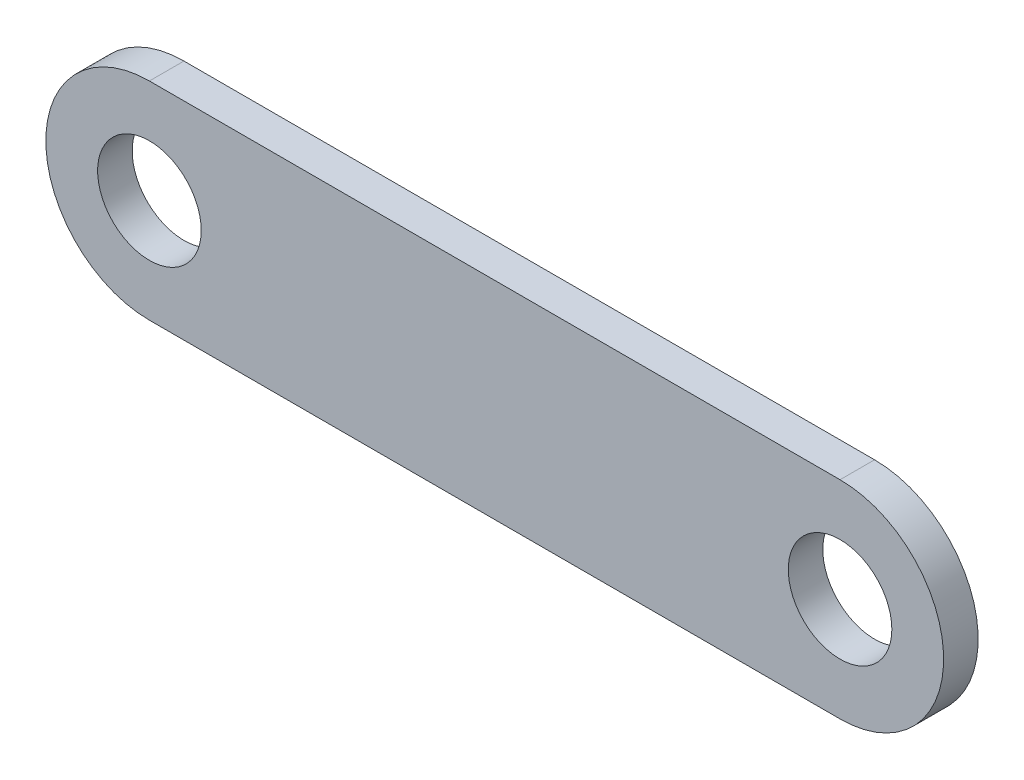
ISO-10303-21;
HEADER;
FILE_DESCRIPTION(('STEP AP214'),'2;1');
FILE_NAME('part.step','',(''),(''),'','','');
FILE_SCHEMA(('AUTOMOTIVE_DESIGN { 1 0 10303 214 1 1 1 1 }'));
ENDSEC;
DATA;
#1=APPLICATION_CONTEXT('core data for automotive mechanical design processes');
#2=APPLICATION_PROTOCOL_DEFINITION('international standard','automotive_design',2000,#1);
#3=PRODUCT_CONTEXT('',#1,'mechanical');
#4=PRODUCT('Part','Part','',(#3));
#5=PRODUCT_RELATED_PRODUCT_CATEGORY('part','',(#4));
#6=PRODUCT_DEFINITION_FORMATION('','',#4);
#7=PRODUCT_DEFINITION_CONTEXT('part definition',#1,'design');
#8=PRODUCT_DEFINITION('design','',#6,#7);
#9=PRODUCT_DEFINITION_SHAPE('','',#8);
#10=(LENGTH_UNIT() NAMED_UNIT(*) SI_UNIT(.MILLI.,.METRE.));
#11=(NAMED_UNIT(*) PLANE_ANGLE_UNIT() SI_UNIT($,.RADIAN.));
#12=(NAMED_UNIT(*) SI_UNIT($,.STERADIAN.) SOLID_ANGLE_UNIT());
#13=UNCERTAINTY_MEASURE_WITH_UNIT(LENGTH_MEASURE(1.E-05),#10,'distance_accuracy_value','');
#14=(GEOMETRIC_REPRESENTATION_CONTEXT(3) GLOBAL_UNCERTAINTY_ASSIGNED_CONTEXT((#13)) GLOBAL_UNIT_ASSIGNED_CONTEXT((#10,
#11,#12)) REPRESENTATION_CONTEXT('',''));
#15=CARTESIAN_POINT('',(0.,0.,0.));
#16=DIRECTION('',(0.,0.,1.));
#17=DIRECTION('',(1.,0.,0.));
#18=AXIS2_PLACEMENT_3D('',#15,#16,#17);
#19=CARTESIAN_POINT('',(-31.75,0.,3.175));
#20=DIRECTION('',(0.,0.,1.));
#21=DIRECTION('',(1.,0.,0.));
#22=AXIS2_PLACEMENT_3D('',#19,#20,#21);
#23=PLANE('',#22);
#24=CARTESIAN_POINT('',(31.75,0.,3.175));
#25=DIRECTION('',(0.,0.,1.));
#26=DIRECTION('',(1.,0.,0.));
#27=AXIS2_PLACEMENT_3D('',#24,#25,#26);
#28=CIRCLE('',#27,4.7625);
#29=CARTESIAN_POINT('',(36.5125,0.,3.175));
#30=VERTEX_POINT('',#29);
#31=EDGE_CURVE('E93',#30,#30,#28,.T.);
#32=ORIENTED_EDGE('',*,*,#31,.F.);
#33=EDGE_LOOP('',(#32));
#34=FACE_BOUND('',#33,.T.);
#35=CARTESIAN_POINT('',(-31.75,0.,3.175));
#36=DIRECTION('',(0.,0.,1.));
#37=DIRECTION('',(1.,0.,0.));
#38=AXIS2_PLACEMENT_3D('',#35,#36,#37);
#39=CIRCLE('',#38,9.525);
#40=CARTESIAN_POINT('',(-31.75,9.525,3.175));
#41=VERTEX_POINT('',#40);
#42=CARTESIAN_POINT('',(-31.75,-9.525,3.175));
#43=VERTEX_POINT('',#42);
#44=EDGE_CURVE('E103',#41,#43,#39,.T.);
#45=ORIENTED_EDGE('',*,*,#44,.T.);
#46=DIRECTION('',(1.,0.,0.));
#47=VECTOR('',#46,1.);
#48=CARTESIAN_POINT('',(-31.75,-9.525,3.175));
#49=LINE('',#48,#47);
#50=CARTESIAN_POINT('',(31.75,-9.525,3.175));
#51=VERTEX_POINT('',#50);
#52=EDGE_CURVE('E88',#43,#51,#49,.T.);
#53=ORIENTED_EDGE('',*,*,#52,.T.);
#54=CARTESIAN_POINT('',(31.75,0.,3.175));
#55=DIRECTION('',(0.,0.,1.));
#56=DIRECTION('',(1.,0.,0.));
#57=AXIS2_PLACEMENT_3D('',#54,#55,#56);
#58=CIRCLE('',#57,9.525);
#59=CARTESIAN_POINT('',(31.75,9.525,3.175));
#60=VERTEX_POINT('',#59);
#61=EDGE_CURVE('E54',#51,#60,#58,.T.);
#62=ORIENTED_EDGE('',*,*,#61,.T.);
#63=DIRECTION('',(-1.,0.,0.));
#64=VECTOR('',#63,1.);
#65=CARTESIAN_POINT('',(-31.75,9.525,3.175));
#66=LINE('',#65,#64);
#67=EDGE_CURVE('E49',#60,#41,#66,.T.);
#68=ORIENTED_EDGE('',*,*,#67,.T.);
#69=EDGE_LOOP('',(#45,#53,#62,#68));
#70=FACE_BOUND('',#69,.T.);
#71=CARTESIAN_POINT('',(-31.75,0.,3.175));
#72=DIRECTION('',(0.,0.,1.));
#73=DIRECTION('',(1.,0.,0.));
#74=AXIS2_PLACEMENT_3D('',#71,#72,#73);
#75=CIRCLE('',#74,4.7625);
#76=CARTESIAN_POINT('',(-26.9875,0.,3.175));
#77=VERTEX_POINT('',#76);
#78=EDGE_CURVE('E121',#77,#77,#75,.T.);
#79=ORIENTED_EDGE('',*,*,#78,.F.);
#80=EDGE_LOOP('',(#79));
#81=FACE_BOUND('',#80,.T.);
#82=ADVANCED_FACE('F34',(#34,#70,#81),#23,.T.);
#83=CARTESIAN_POINT('',(-31.75,0.,0.));
#84=DIRECTION('',(0.,0.,1.));
#85=DIRECTION('',(1.,0.,0.));
#86=AXIS2_PLACEMENT_3D('',#83,#84,#85);
#87=PLANE('',#86);
#88=CARTESIAN_POINT('',(31.75,0.,0.));
#89=DIRECTION('',(0.,0.,1.));
#90=DIRECTION('',(1.,0.,0.));
#91=AXIS2_PLACEMENT_3D('',#88,#89,#90);
#92=CIRCLE('',#91,4.7625);
#93=CARTESIAN_POINT('',(36.5125,0.,0.));
#94=VERTEX_POINT('',#93);
#95=EDGE_CURVE('E96',#94,#94,#92,.T.);
#96=ORIENTED_EDGE('',*,*,#95,.T.);
#97=EDGE_LOOP('',(#96));
#98=FACE_BOUND('',#97,.T.);
#99=CARTESIAN_POINT('',(-31.75,0.,0.));
#100=DIRECTION('',(0.,0.,1.));
#101=DIRECTION('',(1.,0.,0.));
#102=AXIS2_PLACEMENT_3D('',#99,#100,#101);
#103=CIRCLE('',#102,9.525);
#104=CARTESIAN_POINT('',(-31.75,9.525,0.));
#105=VERTEX_POINT('',#104);
#106=CARTESIAN_POINT('',(-31.75,-9.525,0.));
#107=VERTEX_POINT('',#106);
#108=EDGE_CURVE('E80',#105,#107,#103,.T.);
#109=ORIENTED_EDGE('',*,*,#108,.F.);
#110=DIRECTION('',(-1.,0.,0.));
#111=VECTOR('',#110,1.);
#112=CARTESIAN_POINT('',(-31.75,9.525,0.));
#113=LINE('',#112,#111);
#114=CARTESIAN_POINT('',(31.75,9.525,0.));
#115=VERTEX_POINT('',#114);
#116=EDGE_CURVE('E101',#115,#105,#113,.T.);
#117=ORIENTED_EDGE('',*,*,#116,.F.);
#118=CARTESIAN_POINT('',(31.75,0.,0.));
#119=DIRECTION('',(0.,0.,1.));
#120=DIRECTION('',(1.,0.,0.));
#121=AXIS2_PLACEMENT_3D('',#118,#119,#120);
#122=CIRCLE('',#121,9.525);
#123=CARTESIAN_POINT('',(31.75,-9.525,0.));
#124=VERTEX_POINT('',#123);
#125=EDGE_CURVE('E81',#124,#115,#122,.T.);
#126=ORIENTED_EDGE('',*,*,#125,.F.);
#127=DIRECTION('',(1.,0.,0.));
#128=VECTOR('',#127,1.);
#129=CARTESIAN_POINT('',(-31.75,-9.525,0.));
#130=LINE('',#129,#128);
#131=EDGE_CURVE('E75',#107,#124,#130,.T.);
#132=ORIENTED_EDGE('',*,*,#131,.F.);
#133=EDGE_LOOP('',(#109,#117,#126,#132));
#134=FACE_BOUND('',#133,.T.);
#135=CARTESIAN_POINT('',(-31.75,0.,0.));
#136=DIRECTION('',(0.,0.,1.));
#137=DIRECTION('',(1.,0.,0.));
#138=AXIS2_PLACEMENT_3D('',#135,#136,#137);
#139=CIRCLE('',#138,4.7625);
#140=CARTESIAN_POINT('',(-26.9875,0.,0.));
#141=VERTEX_POINT('',#140);
#142=EDGE_CURVE('E123',#141,#141,#139,.T.);
#143=ORIENTED_EDGE('',*,*,#142,.T.);
#144=EDGE_LOOP('',(#143));
#145=FACE_BOUND('',#144,.T.);
#146=ADVANCED_FACE('F76',(#98,#134,#145),#87,.F.);
#147=CARTESIAN_POINT('',(-31.75,0.,3.175));
#148=DIRECTION('',(0.,0.,-1.));
#149=DIRECTION('',(-1.,0.,0.));
#150=AXIS2_PLACEMENT_3D('',#147,#148,#149);
#151=CYLINDRICAL_SURFACE('',#150,9.525);
#152=ORIENTED_EDGE('',*,*,#108,.T.);
#153=DIRECTION('',(0.,0.,-1.));
#154=VECTOR('',#153,1.);
#155=CARTESIAN_POINT('',(-31.75,-9.525,3.175));
#156=LINE('',#155,#154);
#157=EDGE_CURVE('E11',#43,#107,#156,.T.);
#158=ORIENTED_EDGE('',*,*,#157,.F.);
#159=ORIENTED_EDGE('',*,*,#44,.F.);
#160=DIRECTION('',(0.,0.,-1.));
#161=VECTOR('',#160,1.);
#162=CARTESIAN_POINT('',(-31.75,9.525,3.175));
#163=LINE('',#162,#161);
#164=EDGE_CURVE('E92',#41,#105,#163,.T.);
#165=ORIENTED_EDGE('',*,*,#164,.T.);
#166=EDGE_LOOP('',(#152,#158,#159,#165));
#167=FACE_BOUND('',#166,.T.);
#168=ADVANCED_FACE('F36',(#167),#151,.T.);
#169=CARTESIAN_POINT('',(-31.75,-9.525,3.175));
#170=DIRECTION('',(0.,1.,0.));
#171=DIRECTION('',(0.,0.,1.));
#172=AXIS2_PLACEMENT_3D('',#169,#170,#171);
#173=PLANE('',#172);
#174=ORIENTED_EDGE('',*,*,#131,.T.);
#175=DIRECTION('',(0.,0.,-1.));
#176=VECTOR('',#175,1.);
#177=CARTESIAN_POINT('',(31.75,-9.525,3.175));
#178=LINE('',#177,#176);
#179=EDGE_CURVE('E42',#51,#124,#178,.T.);
#180=ORIENTED_EDGE('',*,*,#179,.F.);
#181=ORIENTED_EDGE('',*,*,#52,.F.);
#182=ORIENTED_EDGE('',*,*,#157,.T.);
#183=EDGE_LOOP('',(#174,#180,#181,#182));
#184=FACE_BOUND('',#183,.T.);
#185=ADVANCED_FACE('F87',(#184),#173,.F.);
#186=CARTESIAN_POINT('',(31.75,0.,3.175));
#187=DIRECTION('',(0.,0.,-1.));
#188=DIRECTION('',(-1.,0.,0.));
#189=AXIS2_PLACEMENT_3D('',#186,#187,#188);
#190=CYLINDRICAL_SURFACE('',#189,9.525);
#191=ORIENTED_EDGE('',*,*,#125,.T.);
#192=DIRECTION('',(0.,0.,-1.));
#193=VECTOR('',#192,1.);
#194=CARTESIAN_POINT('',(31.75,9.525,3.175));
#195=LINE('',#194,#193);
#196=EDGE_CURVE('E109',#60,#115,#195,.T.);
#197=ORIENTED_EDGE('',*,*,#196,.F.);
#198=ORIENTED_EDGE('',*,*,#61,.F.);
#199=ORIENTED_EDGE('',*,*,#179,.T.);
#200=EDGE_LOOP('',(#191,#197,#198,#199));
#201=FACE_BOUND('',#200,.T.);
#202=ADVANCED_FACE('F112',(#201),#190,.T.);
#203=CARTESIAN_POINT('',(-31.75,9.525,3.175));
#204=DIRECTION('',(0.,-1.,0.));
#205=DIRECTION('',(0.,0.,-1.));
#206=AXIS2_PLACEMENT_3D('',#203,#204,#205);
#207=PLANE('',#206);
#208=ORIENTED_EDGE('',*,*,#116,.T.);
#209=ORIENTED_EDGE('',*,*,#164,.F.);
#210=ORIENTED_EDGE('',*,*,#67,.F.);
#211=ORIENTED_EDGE('',*,*,#196,.T.);
#212=EDGE_LOOP('',(#208,#209,#210,#211));
#213=FACE_BOUND('',#212,.T.);
#214=ADVANCED_FACE('F114',(#213),#207,.F.);
#215=CARTESIAN_POINT('',(31.75,0.,3.175));
#216=DIRECTION('',(0.,0.,-1.));
#217=DIRECTION('',(-1.,0.,0.));
#218=AXIS2_PLACEMENT_3D('',#215,#216,#217);
#219=CYLINDRICAL_SURFACE('',#218,4.7625);
#220=ORIENTED_EDGE('',*,*,#31,.T.);
#221=EDGE_LOOP('',(#220));
#222=FACE_BOUND('',#221,.T.);
#223=ORIENTED_EDGE('',*,*,#95,.F.);
#224=EDGE_LOOP('',(#223));
#225=FACE_BOUND('',#224,.T.);
#226=ADVANCED_FACE('F132',(#222,#225),#219,.F.);
#227=CARTESIAN_POINT('',(-31.75,0.,3.175));
#228=DIRECTION('',(0.,0.,-1.));
#229=DIRECTION('',(-1.,0.,0.));
#230=AXIS2_PLACEMENT_3D('',#227,#228,#229);
#231=CYLINDRICAL_SURFACE('',#230,4.7625);
#232=ORIENTED_EDGE('',*,*,#78,.T.);
#233=EDGE_LOOP('',(#232));
#234=FACE_BOUND('',#233,.T.);
#235=ORIENTED_EDGE('',*,*,#142,.F.);
#236=EDGE_LOOP('',(#235));
#237=FACE_BOUND('',#236,.T.);
#238=ADVANCED_FACE('F130',(#234,#237),#231,.F.);
#239=CLOSED_SHELL('',(#82,#146,#168,#185,#202,#214,#226,#238));
#240=MANIFOLD_SOLID_BREP('B2',#239);
#241=ADVANCED_BREP_SHAPE_REPRESENTATION('',(#18,#240),#14);
#242=SHAPE_DEFINITION_REPRESENTATION(#9,#241);
ENDSEC;
END-ISO-10303-21;
